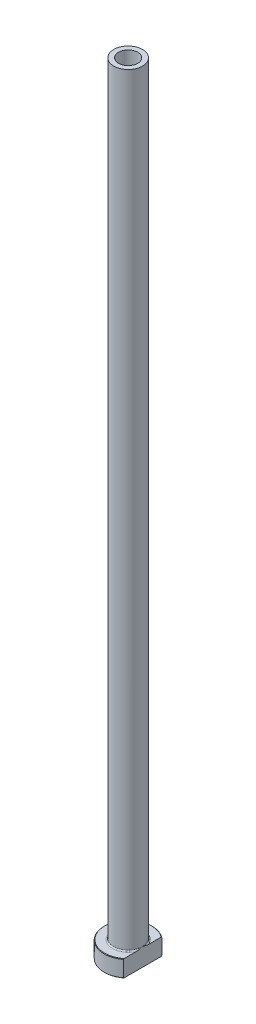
from build123d import *

# Parameters (mm, degrees)
FILLET1_R          = 0.5
CHAMFER1_SIZE      = 0.2
CUT_EXTRUDE1_DEPTH = 326.307546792
CHAMFER2_SIZE      = 0.5


with BuildPart() as part:
    # Sketch1 → Revolve1 (revolve)
    with BuildSketch(Plane.XY, mode=Mode.PRIVATE) as revolve1_sk:
        Polygon((-4, 325), (-6, 325), (-6, 7), (-10, 7), (-10, 0), (-4.25, 0), (-4.25, 268), (-4, 280), align=None)
    revolve(revolve1_sk.sketch.rotate(Axis((0, 92.187680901, 0), (0, -1, 0)), 270), axis=Axis((0, 92.187680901, 0), (0, -1, 0)))

    # Fillet1
    fillet1_edges = [part.edges().sort_by_distance(p)[0] for p in [
        (0, 7, -6),
    ]]
    fillet(fillet1_edges, radius=FILLET1_R)

    # Chamfer1
    chamfer1_edges = [part.edges().sort_by_distance(p)[0] for p in [
        (0, 0, -10),
        (0, 7, -10),
    ]]
    chamfer(chamfer1_edges, length=CHAMFER1_SIZE)

    # Sketch2 → Cut-Extrude1 (cut, through all)
    with BuildSketch(Plane.XZ):
        with BuildLine():
            Line((6, 8), (6, -8))
            ThreePointArc((6, -8), (10, 0), (6, 8))
        make_face()
    extrude(amount=-CUT_EXTRUDE1_DEPTH, mode=Mode.SUBTRACT)

    # Chamfer2
    chamfer2_edges = [part.edges().sort_by_distance(p)[0] for p in [
        (0, 0, -4.25),
    ]]
    chamfer(chamfer2_edges, length=CHAMFER2_SIZE)


solid = part.part
